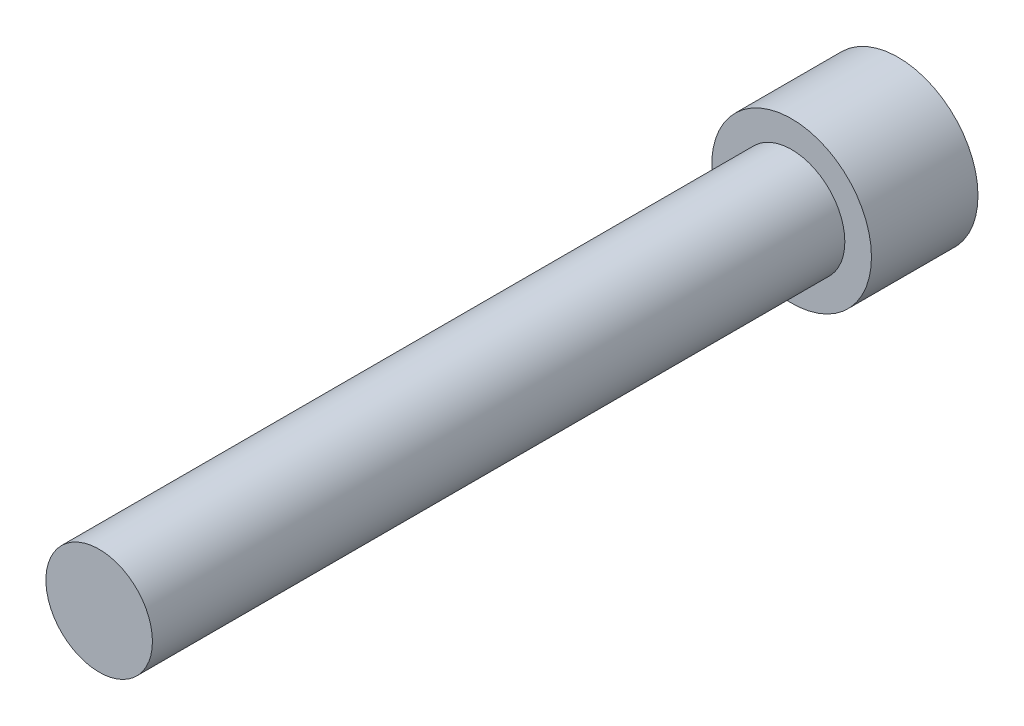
ISO-10303-21;
HEADER;
FILE_DESCRIPTION(('STEP AP214'),'2;1');
FILE_NAME('part.step','',(''),(''),'','','');
FILE_SCHEMA(('AUTOMOTIVE_DESIGN { 1 0 10303 214 1 1 1 1 }'));
ENDSEC;
DATA;
#1=APPLICATION_CONTEXT('core data for automotive mechanical design processes');
#2=APPLICATION_PROTOCOL_DEFINITION('international standard','automotive_design',2000,#1);
#3=PRODUCT_CONTEXT('',#1,'mechanical');
#4=PRODUCT('Part','Part','',(#3));
#5=PRODUCT_RELATED_PRODUCT_CATEGORY('part','',(#4));
#6=PRODUCT_DEFINITION_FORMATION('','',#4);
#7=PRODUCT_DEFINITION_CONTEXT('part definition',#1,'design');
#8=PRODUCT_DEFINITION('design','',#6,#7);
#9=PRODUCT_DEFINITION_SHAPE('','',#8);
#10=(LENGTH_UNIT() NAMED_UNIT(*) SI_UNIT(.MILLI.,.METRE.));
#11=(NAMED_UNIT(*) PLANE_ANGLE_UNIT() SI_UNIT($,.RADIAN.));
#12=(NAMED_UNIT(*) SI_UNIT($,.STERADIAN.) SOLID_ANGLE_UNIT());
#13=UNCERTAINTY_MEASURE_WITH_UNIT(LENGTH_MEASURE(1.E-05),#10,'distance_accuracy_value','');
#14=(GEOMETRIC_REPRESENTATION_CONTEXT(3) GLOBAL_UNCERTAINTY_ASSIGNED_CONTEXT((#13)) GLOBAL_UNIT_ASSIGNED_CONTEXT((#10,
#11,#12)) REPRESENTATION_CONTEXT('',''));
#15=CARTESIAN_POINT('',(0.,0.,0.));
#16=DIRECTION('',(0.,0.,1.));
#17=DIRECTION('',(1.,0.,0.));
#18=AXIS2_PLACEMENT_3D('',#15,#16,#17);
#19=CARTESIAN_POINT('',(0.,-4.7625,-6.35));
#20=DIRECTION('',(0.,0.,-1.));
#21=DIRECTION('',(-1.,0.,0.));
#22=AXIS2_PLACEMENT_3D('',#19,#20,#21);
#23=PLANE('',#22);
#24=DIRECTION('',(0.866025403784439,-0.5,0.));
#25=VECTOR('',#24,1.);
#26=CARTESIAN_POINT('',(0.,2.7569630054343,-6.35));
#27=LINE('',#26,#25);
#28=CARTESIAN_POINT('',(0.,2.7569630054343,-6.35));
#29=VERTEX_POINT('',#28);
#30=CARTESIAN_POINT('',(2.3876,1.37848150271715,-6.35));
#31=VERTEX_POINT('',#30);
#32=EDGE_CURVE('E47',#29,#31,#27,.T.);
#33=ORIENTED_EDGE('',*,*,#32,.F.);
#34=DIRECTION('',(0.866025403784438,0.5,0.));
#35=VECTOR('',#34,1.);
#36=CARTESIAN_POINT('',(-2.3876,1.37848150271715,-6.35));
#37=LINE('',#36,#35);
#38=CARTESIAN_POINT('',(-2.3876,1.37848150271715,-6.35));
#39=VERTEX_POINT('',#38);
#40=EDGE_CURVE('E130',#39,#29,#37,.T.);
#41=ORIENTED_EDGE('',*,*,#40,.F.);
#42=DIRECTION('',(0.,1.,0.));
#43=VECTOR('',#42,1.);
#44=CARTESIAN_POINT('',(-2.3876,-1.37848150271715,-6.35));
#45=LINE('',#44,#43);
#46=CARTESIAN_POINT('',(-2.3876,-1.37848150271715,-6.35));
#47=VERTEX_POINT('',#46);
#48=EDGE_CURVE('E128',#47,#39,#45,.T.);
#49=ORIENTED_EDGE('',*,*,#48,.F.);
#50=DIRECTION('',(-0.866025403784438,0.5,0.));
#51=VECTOR('',#50,1.);
#52=CARTESIAN_POINT('',(0.,-2.7569630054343,-6.35));
#53=LINE('',#52,#51);
#54=CARTESIAN_POINT('',(0.,-2.7569630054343,-6.35));
#55=VERTEX_POINT('',#54);
#56=EDGE_CURVE('E95',#55,#47,#53,.T.);
#57=ORIENTED_EDGE('',*,*,#56,.F.);
#58=DIRECTION('',(-0.866025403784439,-0.5,0.));
#59=VECTOR('',#58,1.);
#60=CARTESIAN_POINT('',(2.3876,-1.37848150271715,-6.35));
#61=LINE('',#60,#59);
#62=CARTESIAN_POINT('',(2.3876,-1.37848150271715,-6.35));
#63=VERTEX_POINT('',#62);
#64=EDGE_CURVE('E124',#63,#55,#61,.T.);
#65=ORIENTED_EDGE('',*,*,#64,.F.);
#66=DIRECTION('',(0.,-1.,0.));
#67=VECTOR('',#66,1.);
#68=CARTESIAN_POINT('',(2.3876,1.37848150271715,-6.35));
#69=LINE('',#68,#67);
#70=EDGE_CURVE('E121',#31,#63,#69,.T.);
#71=ORIENTED_EDGE('',*,*,#70,.F.);
#72=EDGE_LOOP('',(#33,#41,#49,#57,#65,#71));
#73=FACE_BOUND('',#72,.T.);
#74=CARTESIAN_POINT('',(0.,0.,-6.35));
#75=DIRECTION('',(0.,0.,1.));
#76=DIRECTION('',(1.,0.,0.));
#77=AXIS2_PLACEMENT_3D('',#74,#75,#76);
#78=CIRCLE('',#77,4.7625);
#79=CARTESIAN_POINT('',(4.7625,0.,-6.35));
#80=VERTEX_POINT('',#79);
#81=EDGE_CURVE('E11',#80,#80,#78,.T.);
#82=ORIENTED_EDGE('',*,*,#81,.F.);
#83=EDGE_LOOP('',(#82));
#84=FACE_BOUND('',#83,.T.);
#85=ADVANCED_FACE('F33',(#73,#84),#23,.T.);
#86=CARTESIAN_POINT('',(0.,0.,41.275));
#87=DIRECTION('',(0.,0.,1.));
#88=DIRECTION('',(1.,0.,0.));
#89=AXIS2_PLACEMENT_3D('',#86,#87,#88);
#90=CYLINDRICAL_SURFACE('',#89,4.7625);
#91=ORIENTED_EDGE('',*,*,#81,.T.);
#92=EDGE_LOOP('',(#91));
#93=FACE_BOUND('',#92,.T.);
#94=CARTESIAN_POINT('',(0.,0.,0.));
#95=DIRECTION('',(0.,0.,1.));
#96=DIRECTION('',(1.,0.,0.));
#97=AXIS2_PLACEMENT_3D('',#94,#95,#96);
#98=CIRCLE('',#97,4.7625);
#99=CARTESIAN_POINT('',(4.7625,0.,0.));
#100=VERTEX_POINT('',#99);
#101=EDGE_CURVE('E40',#100,#100,#98,.T.);
#102=ORIENTED_EDGE('',*,*,#101,.F.);
#103=EDGE_LOOP('',(#102));
#104=FACE_BOUND('',#103,.T.);
#105=ADVANCED_FACE('F150',(#93,#104),#90,.T.);
#106=CARTESIAN_POINT('',(0.,-3.175,0.));
#107=DIRECTION('',(0.,0.,1.));
#108=DIRECTION('',(1.,0.,0.));
#109=AXIS2_PLACEMENT_3D('',#106,#107,#108);
#110=PLANE('',#109);
#111=ORIENTED_EDGE('',*,*,#101,.T.);
#112=EDGE_LOOP('',(#111));
#113=FACE_BOUND('',#112,.T.);
#114=CARTESIAN_POINT('',(0.,0.,0.));
#115=DIRECTION('',(0.,0.,1.));
#116=DIRECTION('',(1.,0.,0.));
#117=AXIS2_PLACEMENT_3D('',#114,#115,#116);
#118=CIRCLE('',#117,3.175);
#119=CARTESIAN_POINT('',(3.175,0.,0.));
#120=VERTEX_POINT('',#119);
#121=EDGE_CURVE('E142',#120,#120,#118,.T.);
#122=ORIENTED_EDGE('',*,*,#121,.F.);
#123=EDGE_LOOP('',(#122));
#124=FACE_BOUND('',#123,.T.);
#125=ADVANCED_FACE('F147',(#113,#124),#110,.T.);
#126=CARTESIAN_POINT('',(0.,0.,41.275));
#127=DIRECTION('',(0.,0.,1.));
#128=DIRECTION('',(1.,0.,0.));
#129=AXIS2_PLACEMENT_3D('',#126,#127,#128);
#130=CYLINDRICAL_SURFACE('',#129,3.175);
#131=ORIENTED_EDGE('',*,*,#121,.T.);
#132=EDGE_LOOP('',(#131));
#133=FACE_BOUND('',#132,.T.);
#134=CARTESIAN_POINT('',(0.,0.,41.275));
#135=DIRECTION('',(0.,0.,1.));
#136=DIRECTION('',(1.,0.,0.));
#137=AXIS2_PLACEMENT_3D('',#134,#135,#136);
#138=CIRCLE('',#137,3.175);
#139=CARTESIAN_POINT('',(3.175,0.,41.275));
#140=VERTEX_POINT('',#139);
#141=EDGE_CURVE('E134',#140,#140,#138,.T.);
#142=ORIENTED_EDGE('',*,*,#141,.F.);
#143=EDGE_LOOP('',(#142));
#144=FACE_BOUND('',#143,.T.);
#145=ADVANCED_FACE('F157',(#133,#144),#130,.T.);
#146=CARTESIAN_POINT('',(0.,0.,41.275));
#147=DIRECTION('',(0.,0.,1.));
#148=DIRECTION('',(1.,0.,0.));
#149=AXIS2_PLACEMENT_3D('',#146,#147,#148);
#150=PLANE('',#149);
#151=ORIENTED_EDGE('',*,*,#141,.T.);
#152=EDGE_LOOP('',(#151));
#153=FACE_BOUND('',#152,.T.);
#154=ADVANCED_FACE('F163',(#153),#150,.T.);
#155=CARTESIAN_POINT('',(0.,2.7569630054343,-2.794));
#156=DIRECTION('',(0.5,0.866025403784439,0.));
#157=DIRECTION('',(-0.866025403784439,0.5,0.));
#158=AXIS2_PLACEMENT_3D('',#155,#156,#157);
#159=PLANE('',#158);
#160=ORIENTED_EDGE('',*,*,#32,.T.);
#161=DIRECTION('',(0.,0.,-1.));
#162=VECTOR('',#161,1.);
#163=CARTESIAN_POINT('',(2.3876,1.37848150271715,-2.794));
#164=LINE('',#163,#162);
#165=CARTESIAN_POINT('',(2.3876,1.37848150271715,-2.794));
#166=VERTEX_POINT('',#165);
#167=EDGE_CURVE('E77',#166,#31,#164,.T.);
#168=ORIENTED_EDGE('',*,*,#167,.F.);
#169=DIRECTION('',(0.866025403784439,-0.5,0.));
#170=VECTOR('',#169,1.);
#171=CARTESIAN_POINT('',(0.,2.7569630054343,-2.794));
#172=LINE('',#171,#170);
#173=CARTESIAN_POINT('',(0.,2.7569630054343,-2.794));
#174=VERTEX_POINT('',#173);
#175=EDGE_CURVE('E132',#174,#166,#172,.T.);
#176=ORIENTED_EDGE('',*,*,#175,.F.);
#177=DIRECTION('',(0.,0.,-1.));
#178=VECTOR('',#177,1.);
#179=CARTESIAN_POINT('',(0.,2.7569630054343,-2.794));
#180=LINE('',#179,#178);
#181=EDGE_CURVE('E55',#174,#29,#180,.T.);
#182=ORIENTED_EDGE('',*,*,#181,.T.);
#183=EDGE_LOOP('',(#160,#168,#176,#182));
#184=FACE_BOUND('',#183,.T.);
#185=ADVANCED_FACE('F167',(#184),#159,.F.);
#186=CARTESIAN_POINT('',(-2.3876,1.37848150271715,-2.794));
#187=DIRECTION('',(-0.5,0.866025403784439,0.));
#188=DIRECTION('',(-0.866025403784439,-0.5,0.));
#189=AXIS2_PLACEMENT_3D('',#186,#187,#188);
#190=PLANE('',#189);
#191=ORIENTED_EDGE('',*,*,#40,.T.);
#192=ORIENTED_EDGE('',*,*,#181,.F.);
#193=DIRECTION('',(0.866025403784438,0.5,0.));
#194=VECTOR('',#193,1.);
#195=CARTESIAN_POINT('',(-2.3876,1.37848150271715,-2.794));
#196=LINE('',#195,#194);
#197=CARTESIAN_POINT('',(-2.3876,1.37848150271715,-2.794));
#198=VERTEX_POINT('',#197);
#199=EDGE_CURVE('E107',#198,#174,#196,.T.);
#200=ORIENTED_EDGE('',*,*,#199,.F.);
#201=DIRECTION('',(0.,0.,-1.));
#202=VECTOR('',#201,1.);
#203=CARTESIAN_POINT('',(-2.3876,1.37848150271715,-2.794));
#204=LINE('',#203,#202);
#205=EDGE_CURVE('E99',#198,#39,#204,.T.);
#206=ORIENTED_EDGE('',*,*,#205,.T.);
#207=EDGE_LOOP('',(#191,#192,#200,#206));
#208=FACE_BOUND('',#207,.T.);
#209=ADVANCED_FACE('F171',(#208),#190,.F.);
#210=CARTESIAN_POINT('',(-2.3876,-1.37848150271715,-2.794));
#211=DIRECTION('',(-1.,0.,0.));
#212=DIRECTION('',(0.,0.,1.));
#213=AXIS2_PLACEMENT_3D('',#210,#211,#212);
#214=PLANE('',#213);
#215=ORIENTED_EDGE('',*,*,#48,.T.);
#216=ORIENTED_EDGE('',*,*,#205,.F.);
#217=DIRECTION('',(0.,1.,0.));
#218=VECTOR('',#217,1.);
#219=CARTESIAN_POINT('',(-2.3876,-1.37848150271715,-2.794));
#220=LINE('',#219,#218);
#221=CARTESIAN_POINT('',(-2.3876,-1.37848150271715,-2.794));
#222=VERTEX_POINT('',#221);
#223=EDGE_CURVE('E103',#222,#198,#220,.T.);
#224=ORIENTED_EDGE('',*,*,#223,.F.);
#225=DIRECTION('',(0.,0.,-1.));
#226=VECTOR('',#225,1.);
#227=CARTESIAN_POINT('',(-2.3876,-1.37848150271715,-2.794));
#228=LINE('',#227,#226);
#229=EDGE_CURVE('E88',#222,#47,#228,.T.);
#230=ORIENTED_EDGE('',*,*,#229,.T.);
#231=EDGE_LOOP('',(#215,#216,#224,#230));
#232=FACE_BOUND('',#231,.T.);
#233=ADVANCED_FACE('F104',(#232),#214,.F.);
#234=CARTESIAN_POINT('',(0.,-2.7569630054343,-2.794));
#235=DIRECTION('',(-0.5,-0.866025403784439,0.));
#236=DIRECTION('',(0.866025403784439,-0.5,0.));
#237=AXIS2_PLACEMENT_3D('',#234,#235,#236);
#238=PLANE('',#237);
#239=ORIENTED_EDGE('',*,*,#56,.T.);
#240=ORIENTED_EDGE('',*,*,#229,.F.);
#241=DIRECTION('',(-0.866025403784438,0.5,0.));
#242=VECTOR('',#241,1.);
#243=CARTESIAN_POINT('',(0.,-2.7569630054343,-2.794));
#244=LINE('',#243,#242);
#245=CARTESIAN_POINT('',(0.,-2.7569630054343,-2.794));
#246=VERTEX_POINT('',#245);
#247=EDGE_CURVE('E92',#246,#222,#244,.T.);
#248=ORIENTED_EDGE('',*,*,#247,.F.);
#249=DIRECTION('',(0.,0.,-1.));
#250=VECTOR('',#249,1.);
#251=CARTESIAN_POINT('',(0.,-2.7569630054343,-2.794));
#252=LINE('',#251,#250);
#253=EDGE_CURVE('E100',#246,#55,#252,.T.);
#254=ORIENTED_EDGE('',*,*,#253,.T.);
#255=EDGE_LOOP('',(#239,#240,#248,#254));
#256=FACE_BOUND('',#255,.T.);
#257=ADVANCED_FACE('F90',(#256),#238,.F.);
#258=CARTESIAN_POINT('',(2.3876,-1.37848150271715,-2.794));
#259=DIRECTION('',(0.5,-0.866025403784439,0.));
#260=DIRECTION('',(0.866025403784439,0.5,0.));
#261=AXIS2_PLACEMENT_3D('',#258,#259,#260);
#262=PLANE('',#261);
#263=ORIENTED_EDGE('',*,*,#64,.T.);
#264=ORIENTED_EDGE('',*,*,#253,.F.);
#265=DIRECTION('',(-0.866025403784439,-0.5,0.));
#266=VECTOR('',#265,1.);
#267=CARTESIAN_POINT('',(2.3876,-1.37848150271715,-2.794));
#268=LINE('',#267,#266);
#269=CARTESIAN_POINT('',(2.3876,-1.37848150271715,-2.794));
#270=VERTEX_POINT('',#269);
#271=EDGE_CURVE('E113',#270,#246,#268,.T.);
#272=ORIENTED_EDGE('',*,*,#271,.F.);
#273=DIRECTION('',(0.,0.,-1.));
#274=VECTOR('',#273,1.);
#275=CARTESIAN_POINT('',(2.3876,-1.37848150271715,-2.794));
#276=LINE('',#275,#274);
#277=EDGE_CURVE('E137',#270,#63,#276,.T.);
#278=ORIENTED_EDGE('',*,*,#277,.T.);
#279=EDGE_LOOP('',(#263,#264,#272,#278));
#280=FACE_BOUND('',#279,.T.);
#281=ADVANCED_FACE('F175',(#280),#262,.F.);
#282=CARTESIAN_POINT('',(2.3876,1.37848150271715,-2.794));
#283=DIRECTION('',(1.,0.,0.));
#284=DIRECTION('',(0.,0.,-1.));
#285=AXIS2_PLACEMENT_3D('',#282,#283,#284);
#286=PLANE('',#285);
#287=ORIENTED_EDGE('',*,*,#70,.T.);
#288=ORIENTED_EDGE('',*,*,#277,.F.);
#289=DIRECTION('',(0.,-1.,0.));
#290=VECTOR('',#289,1.);
#291=CARTESIAN_POINT('',(2.3876,1.37848150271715,-2.794));
#292=LINE('',#291,#290);
#293=EDGE_CURVE('E115',#166,#270,#292,.T.);
#294=ORIENTED_EDGE('',*,*,#293,.F.);
#295=ORIENTED_EDGE('',*,*,#167,.T.);
#296=EDGE_LOOP('',(#287,#288,#294,#295));
#297=FACE_BOUND('',#296,.T.);
#298=ADVANCED_FACE('F172',(#297),#286,.F.);
#299=CARTESIAN_POINT('',(0.,2.7569630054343,-2.794));
#300=DIRECTION('',(0.,0.,1.));
#301=DIRECTION('',(1.,0.,0.));
#302=AXIS2_PLACEMENT_3D('',#299,#300,#301);
#303=PLANE('',#302);
#304=ORIENTED_EDGE('',*,*,#175,.T.);
#305=ORIENTED_EDGE('',*,*,#293,.T.);
#306=ORIENTED_EDGE('',*,*,#271,.T.);
#307=ORIENTED_EDGE('',*,*,#247,.T.);
#308=ORIENTED_EDGE('',*,*,#223,.T.);
#309=ORIENTED_EDGE('',*,*,#199,.T.);
#310=EDGE_LOOP('',(#304,#305,#306,#307,#308,#309));
#311=FACE_BOUND('',#310,.T.);
#312=ADVANCED_FACE('F110',(#311),#303,.F.);
#313=CLOSED_SHELL('',(#85,#105,#125,#145,#154,#185,#209,#233,#257,#281,#298,#312));
#314=MANIFOLD_SOLID_BREP('B2',#313);
#315=ADVANCED_BREP_SHAPE_REPRESENTATION('',(#18,#314),#14);
#316=SHAPE_DEFINITION_REPRESENTATION(#9,#315);
ENDSEC;
END-ISO-10303-21;
